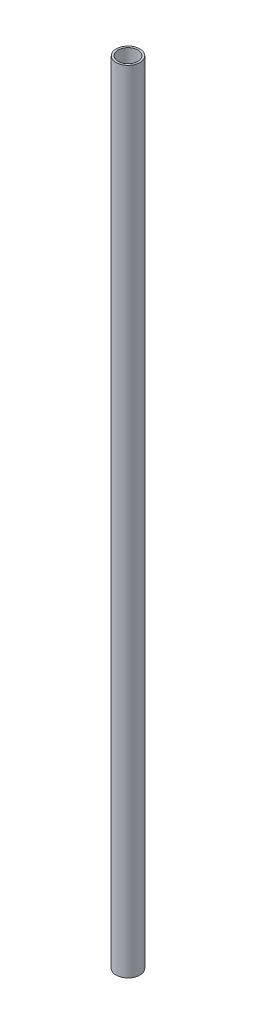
from build123d import *

# Parameters (mm, degrees)
ESQUISSE1_R      = 6
ESQUISSE1_R_2    = 5
EXTRUSION1_DEPTH = 400


with BuildPart() as part:
    # Esquisse1 → Extrusion1 (new body)
    with BuildSketch(Plane(origin=(0, 0, 0), x_dir=(1, 0, 0), z_dir=(0, 1, 0))):
        with Locations(Location((0, 0, 0), (0, 0, 270))):
            Circle(ESQUISSE1_R)
        with Locations(Location((0, 0, 0), (0, 0, 270))):
            Circle(ESQUISSE1_R_2, mode=Mode.SUBTRACT)
    extrude(amount=EXTRUSION1_DEPTH)


solid = part.part
